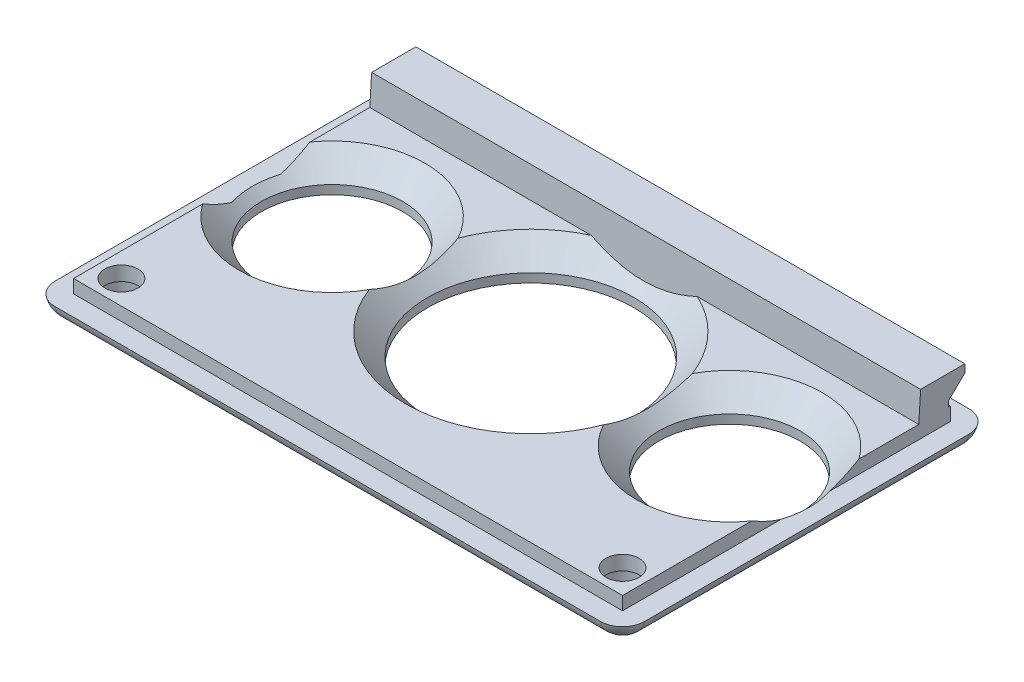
ISO-10303-21;
HEADER;
FILE_DESCRIPTION(('STEP AP214'),'2;1');
FILE_NAME('part.step','',(''),(''),'','','');
FILE_SCHEMA(('AUTOMOTIVE_DESIGN { 1 0 10303 214 1 1 1 1 }'));
ENDSEC;
DATA;
#1=APPLICATION_CONTEXT('core data for automotive mechanical design processes');
#2=APPLICATION_PROTOCOL_DEFINITION('international standard','automotive_design',2000,#1);
#3=PRODUCT_CONTEXT('',#1,'mechanical');
#4=PRODUCT('Part','Part','',(#3));
#5=PRODUCT_RELATED_PRODUCT_CATEGORY('part','',(#4));
#6=PRODUCT_DEFINITION_FORMATION('','',#4);
#7=PRODUCT_DEFINITION_CONTEXT('part definition',#1,'design');
#8=PRODUCT_DEFINITION('design','',#6,#7);
#9=PRODUCT_DEFINITION_SHAPE('','',#8);
#10=(LENGTH_UNIT() NAMED_UNIT(*) SI_UNIT(.MILLI.,.METRE.));
#11=(NAMED_UNIT(*) PLANE_ANGLE_UNIT() SI_UNIT($,.RADIAN.));
#12=(NAMED_UNIT(*) SI_UNIT($,.STERADIAN.) SOLID_ANGLE_UNIT());
#13=UNCERTAINTY_MEASURE_WITH_UNIT(LENGTH_MEASURE(1.E-05),#10,'distance_accuracy_value','');
#14=(GEOMETRIC_REPRESENTATION_CONTEXT(3) GLOBAL_UNCERTAINTY_ASSIGNED_CONTEXT((#13)) GLOBAL_UNIT_ASSIGNED_CONTEXT((#10,
#11,#12)) REPRESENTATION_CONTEXT('',''));
#15=CARTESIAN_POINT('',(0.,0.,0.));
#16=DIRECTION('',(0.,0.,1.));
#17=DIRECTION('',(1.,0.,0.));
#18=AXIS2_PLACEMENT_3D('',#15,#16,#17);
#19=CARTESIAN_POINT('',(1.50366568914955,4.2,-48.4230205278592));
#20=DIRECTION('',(1.,0.,0.));
#21=DIRECTION('',(0.,0.,-1.));
#22=AXIS2_PLACEMENT_3D('',#19,#20,#21);
#23=PLANE('',#22);
#24=DIRECTION('',(0.,0.,1.));
#25=VECTOR('',#24,1.);
#26=CARTESIAN_POINT('',(1.50366568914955,4.2,-48.4230205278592));
#27=LINE('',#26,#25);
#28=CARTESIAN_POINT('',(1.50366568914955,4.2,-21.4443685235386));
#29=VERTEX_POINT('',#28);
#30=CARTESIAN_POINT('',(1.50366568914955,4.2,-3.92302052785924));
#31=VERTEX_POINT('',#30);
#32=EDGE_CURVE('E321',#29,#31,#27,.T.);
#33=ORIENTED_EDGE('',*,*,#32,.F.);
#34=CARTESIAN_POINT('',(1.50366568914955,4.2,-21.4443685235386));
#35=CARTESIAN_POINT('',(1.50366568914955,4.0910620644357,-21.6329773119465));
#36=CARTESIAN_POINT('',(1.50366568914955,3.98420912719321,-21.8228077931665));
#37=CARTESIAN_POINT('',(1.50366568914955,3.77530995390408,-22.2051455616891));
#38=CARTESIAN_POINT('',(1.50366568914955,3.67326476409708,-22.397653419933));
#39=CARTESIAN_POINT('',(1.50366568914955,3.47519291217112,-22.7844679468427));
#40=CARTESIAN_POINT('',(1.50366568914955,3.37913716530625,-22.9787596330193));
#41=CARTESIAN_POINT('',(1.50366568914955,3.19324885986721,-23.3702760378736));
#42=CARTESIAN_POINT('',(1.50366568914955,3.10341620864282,-23.5675007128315));
#43=CARTESIAN_POINT('',(1.50366568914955,2.8442324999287,-24.1644796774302));
#44=CARTESIAN_POINT('',(1.50366568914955,2.68547636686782,-24.5690008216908));
#45=CARTESIAN_POINT('',(1.50366568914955,2.40382511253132,-25.392615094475));
#46=CARTESIAN_POINT('',(1.50366568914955,2.28112452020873,-25.8117740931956));
#47=CARTESIAN_POINT('',(1.50366568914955,2.18117741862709,-26.2370417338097));
#48=B_SPLINE_CURVE_WITH_KNOTS('',3,(#34,#35,#36,#37,#38,#39,#40,#41,#42,#43,#44,#45,#46,#47),
.UNSPECIFIED.,.F.,.F.,(4,2,2,2,2,2,4),(0.,0.653434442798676,1.30701043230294,1.95711545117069,
2.60721078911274,3.90921891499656,5.21812789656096),.UNSPECIFIED.);
#49=CARTESIAN_POINT('',(1.50366568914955,2.4,-25.4277549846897));
#50=VERTEX_POINT('',#49);
#51=EDGE_CURVE('E71',#29,#50,#48,.T.);
#52=ORIENTED_EDGE('',*,*,#51,.T.);
#53=DIRECTION('',(0.,0.,1.));
#54=VECTOR('',#53,1.);
#55=CARTESIAN_POINT('',(1.50366568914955,2.4,-48.4230205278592));
#56=LINE('',#55,#54);
#57=CARTESIAN_POINT('',(1.50366568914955,2.4,-3.92302052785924));
#58=VERTEX_POINT('',#57);
#59=EDGE_CURVE('E338',#50,#58,#56,.T.);
#60=ORIENTED_EDGE('',*,*,#59,.T.);
#61=DIRECTION('',(0.,-1.,0.));
#62=VECTOR('',#61,1.);
#63=CARTESIAN_POINT('',(1.50366568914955,4.2,-3.92302052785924));
#64=LINE('',#63,#62);
#65=EDGE_CURVE('E349',#31,#58,#64,.T.);
#66=ORIENTED_EDGE('',*,*,#65,.F.);
#67=EDGE_LOOP('',(#33,#52,#60,#66));
#68=FACE_BOUND('',#67,.T.);
#69=ADVANCED_FACE('F47',(#68),#23,.F.);
#70=CARTESIAN_POINT('',(76.0036656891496,4.2,-48.4230205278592));
#71=DIRECTION('',(-1.,0.,0.));
#72=DIRECTION('',(0.,0.,1.));
#73=AXIS2_PLACEMENT_3D('',#70,#71,#72);
#74=PLANE('',#73);
#75=DIRECTION('',(0.,0.,-1.));
#76=VECTOR('',#75,1.);
#77=CARTESIAN_POINT('',(76.0036656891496,4.2,-48.4230205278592));
#78=LINE('',#77,#76);
#79=CARTESIAN_POINT('',(76.0036656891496,4.2,-36.0016725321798));
#80=VERTEX_POINT('',#79);
#81=CARTESIAN_POINT('',(76.0036656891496,4.2,-44.1230205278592));
#82=VERTEX_POINT('',#81);
#83=EDGE_CURVE('E318',#80,#82,#78,.T.);
#84=ORIENTED_EDGE('',*,*,#83,.F.);
#85=CARTESIAN_POINT('',(76.0036656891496,4.2,-36.0016725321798));
#86=CARTESIAN_POINT('',(76.0036656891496,4.0910620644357,-35.8130637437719));
#87=CARTESIAN_POINT('',(76.0036656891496,3.98420912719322,-35.623233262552));
#88=CARTESIAN_POINT('',(76.0036656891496,3.77530995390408,-35.2408954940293));
#89=CARTESIAN_POINT('',(76.0036656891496,3.67326476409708,-35.0483876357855));
#90=CARTESIAN_POINT('',(76.0036656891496,3.47519291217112,-34.6615731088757));
#91=CARTESIAN_POINT('',(76.0036656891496,3.37913716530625,-34.4672814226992));
#92=CARTESIAN_POINT('',(76.0036656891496,3.19324885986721,-34.0757650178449));
#93=CARTESIAN_POINT('',(76.0036656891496,3.10341620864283,-33.878540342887));
#94=CARTESIAN_POINT('',(76.0036656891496,2.84423249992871,-33.2815613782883));
#95=CARTESIAN_POINT('',(76.0036656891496,2.68547636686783,-32.8770402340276));
#96=CARTESIAN_POINT('',(76.0036656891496,2.40382511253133,-32.0534259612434));
#97=CARTESIAN_POINT('',(76.0036656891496,2.28112452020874,-31.6342669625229));
#98=CARTESIAN_POINT('',(76.0036656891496,2.1811774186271,-31.2089993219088));
#99=B_SPLINE_CURVE_WITH_KNOTS('',3,(#85,#86,#87,#88,#89,#90,#91,#92,#93,#94,#95,#96,#97,#98),
.UNSPECIFIED.,.F.,.F.,(4,2,2,2,2,2,4),(0.,0.653434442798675,1.30701043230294,1.95711545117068,
2.60721078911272,3.90921891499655,5.21812789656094),.UNSPECIFIED.);
#100=CARTESIAN_POINT('',(76.0036656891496,2.4,-32.0182860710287));
#101=VERTEX_POINT('',#100);
#102=EDGE_CURVE('E476',#80,#101,#99,.T.);
#103=ORIENTED_EDGE('',*,*,#102,.T.);
#104=DIRECTION('',(0.,0.,-1.));
#105=VECTOR('',#104,1.);
#106=CARTESIAN_POINT('',(76.0036656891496,2.4,-48.4230205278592));
#107=LINE('',#106,#105);
#108=CARTESIAN_POINT('',(76.0036656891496,2.4,-48.4230205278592));
#109=VERTEX_POINT('',#108);
#110=EDGE_CURVE('E312',#101,#109,#107,.T.);
#111=ORIENTED_EDGE('',*,*,#110,.T.);
#112=DIRECTION('',(0.,-1.,0.));
#113=VECTOR('',#112,1.);
#114=CARTESIAN_POINT('',(76.0036656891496,4.2,-48.4230205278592));
#115=LINE('',#114,#113);
#116=CARTESIAN_POINT('',(76.0036656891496,4.2,-48.4230205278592));
#117=VERTEX_POINT('',#116);
#118=EDGE_CURVE('E357',#117,#109,#115,.T.);
#119=ORIENTED_EDGE('',*,*,#118,.F.);
#120=CARTESIAN_POINT('',(76.0036656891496,4.2,-48.1230205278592));
#121=VERTEX_POINT('',#120);
#122=EDGE_CURVE('E252',#121,#117,#78,.T.);
#123=ORIENTED_EDGE('',*,*,#122,.F.);
#124=DIRECTION('',(0.,0.999687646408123,-0.0249921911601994));
#125=VECTOR('',#124,1.);
#126=CARTESIAN_POINT('',(76.0036656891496,4.97826358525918,-48.1424771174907));
#127=LINE('',#126,#125);
#128=CARTESIAN_POINT('',(76.0036656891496,4.97826358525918,-48.1424771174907));
#129=VERTEX_POINT('',#128);
#130=EDGE_CURVE('E229',#121,#129,#127,.T.);
#131=ORIENTED_EDGE('',*,*,#130,.T.);
#132=DIRECTION('',(0.,0.689213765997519,-0.724558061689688));
#133=VECTOR('',#132,1.);
#134=CARTESIAN_POINT('',(76.0036656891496,4.97826358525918,-48.1424771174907));
#135=LINE('',#134,#133);
#136=CARTESIAN_POINT('',(76.0036656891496,7.1,-50.3730205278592));
#137=VERTEX_POINT('',#136);
#138=EDGE_CURVE('E239',#129,#137,#135,.T.);
#139=ORIENTED_EDGE('',*,*,#138,.T.);
#140=DIRECTION('',(0.,1.,0.));
#141=VECTOR('',#140,1.);
#142=CARTESIAN_POINT('',(76.0036656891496,8.2,-50.3730205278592));
#143=LINE('',#142,#141);
#144=CARTESIAN_POINT('',(76.0036656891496,8.2,-50.3730205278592));
#145=VERTEX_POINT('',#144);
#146=EDGE_CURVE('E246',#137,#145,#143,.T.);
#147=ORIENTED_EDGE('',*,*,#146,.T.);
#148=DIRECTION('',(0.,0.,1.));
#149=VECTOR('',#148,1.);
#150=CARTESIAN_POINT('',(76.0036656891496,8.2,-44.3730205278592));
#151=LINE('',#150,#149);
#152=CARTESIAN_POINT('',(76.0036656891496,8.2,-44.3730205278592));
#153=VERTEX_POINT('',#152);
#154=EDGE_CURVE('E265',#145,#153,#151,.T.);
#155=ORIENTED_EDGE('',*,*,#154,.T.);
#156=DIRECTION('',(0.,-0.998052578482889,0.0623782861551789));
#157=VECTOR('',#156,1.);
#158=CARTESIAN_POINT('',(76.0036656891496,4.2,-44.1230205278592));
#159=LINE('',#158,#157);
#160=EDGE_CURVE('E236',#153,#82,#159,.T.);
#161=ORIENTED_EDGE('',*,*,#160,.T.);
#162=EDGE_LOOP('',(#84,#103,#111,#119,#123,#131,#139,#147,#155,#161));
#163=FACE_BOUND('',#162,.T.);
#164=ADVANCED_FACE('F250',(#163),#74,.F.);
#165=CARTESIAN_POINT('',(0.,4.2,0.));
#166=DIRECTION('',(0.,1.,0.));
#167=DIRECTION('',(0.,0.,1.));
#168=AXIS2_PLACEMENT_3D('',#165,#166,#167);
#169=PLANE('',#168);
#170=CARTESIAN_POINT('',(38.7536656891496,4.2,-28.7230205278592));
#171=DIRECTION('',(0.,1.,0.));
#172=DIRECTION('',(0.,0.,1.));
#173=AXIS2_PLACEMENT_3D('',#170,#171,#172);
#174=CIRCLE('',#173,17.);
#175=CARTESIAN_POINT('',(45.9536656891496,4.2,-44.1230205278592));
#176=VERTEX_POINT('',#175);
#177=CARTESIAN_POINT('',(54.6511480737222,4.2,-34.7454829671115));
#178=VERTEX_POINT('',#177);
#179=EDGE_CURVE('E460',#176,#178,#174,.F.);
#180=ORIENTED_EDGE('',*,*,#179,.T.);
#181=CARTESIAN_POINT('',(65.7186656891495,4.2,-28.7230205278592));
#182=DIRECTION('',(0.,1.,0.));
#183=DIRECTION('',(0.,0.,1.));
#184=AXIS2_PLACEMENT_3D('',#181,#182,#183);
#185=CIRCLE('',#184,12.6);
#186=EDGE_CURVE('E463',#178,#80,#185,.F.);
#187=ORIENTED_EDGE('',*,*,#186,.T.);
#188=ORIENTED_EDGE('',*,*,#83,.T.);
#189=DIRECTION('',(1.,0.,0.));
#190=VECTOR('',#189,1.);
#191=CARTESIAN_POINT('',(-5.91674535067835,4.2,-44.1230205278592));
#192=LINE('',#191,#190);
#193=EDGE_CURVE('E280',#176,#82,#192,.T.);
#194=ORIENTED_EDGE('',*,*,#193,.F.);
#195=EDGE_LOOP('',(#180,#187,#188,#194));
#196=FACE_BOUND('',#195,.T.);
#197=ADVANCED_FACE('F604',(#196),#169,.T.);
#198=CARTESIAN_POINT('',(72.7536656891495,4.2,-7.17302052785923));
#199=DIRECTION('',(0.,-1.,0.));
#200=DIRECTION('',(0.,0.,-1.));
#201=AXIS2_PLACEMENT_3D('',#198,#199,#200);
#202=CIRCLE('',#201,2.25);
#203=CARTESIAN_POINT('',(72.7536656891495,4.2,-9.42302052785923));
#204=VERTEX_POINT('',#203);
#205=EDGE_CURVE('E302',#204,#204,#202,.T.);
#206=ORIENTED_EDGE('',*,*,#205,.T.);
#207=EDGE_LOOP('',(#206));
#208=FACE_BOUND('',#207,.T.);
#209=CARTESIAN_POINT('',(4.75366568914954,4.2,-7.17302052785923));
#210=DIRECTION('',(0.,-1.,0.));
#211=DIRECTION('',(0.,0.,-1.));
#212=AXIS2_PLACEMENT_3D('',#209,#210,#211);
#213=CIRCLE('',#212,2.25);
#214=CARTESIAN_POINT('',(4.75366568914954,4.2,-9.42302052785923));
#215=VERTEX_POINT('',#214);
#216=EDGE_CURVE('E292',#215,#215,#213,.T.);
#217=ORIENTED_EDGE('',*,*,#216,.T.);
#218=EDGE_LOOP('',(#217));
#219=FACE_BOUND('',#218,.T.);
#220=CARTESIAN_POINT('',(76.0036656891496,4.2,-3.92302052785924));
#221=VERTEX_POINT('',#220);
#222=CARTESIAN_POINT('',(76.0036656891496,4.2,-21.4443685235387));
#223=VERTEX_POINT('',#222);
#224=EDGE_CURVE('E313',#221,#223,#78,.T.);
#225=ORIENTED_EDGE('',*,*,#224,.T.);
#226=CARTESIAN_POINT('',(65.7186656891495,4.2,-28.7230205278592));
#227=DIRECTION('',(0.,1.,0.));
#228=DIRECTION('',(0.,0.,1.));
#229=AXIS2_PLACEMENT_3D('',#226,#227,#228);
#230=CIRCLE('',#229,12.6);
#231=CARTESIAN_POINT('',(54.6511480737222,4.2,-22.700558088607));
#232=VERTEX_POINT('',#231);
#233=EDGE_CURVE('E457',#223,#232,#230,.F.);
#234=ORIENTED_EDGE('',*,*,#233,.T.);
#235=CARTESIAN_POINT('',(38.7536656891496,4.2,-28.7230205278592));
#236=DIRECTION('',(0.,1.,0.));
#237=DIRECTION('',(0.,0.,1.));
#238=AXIS2_PLACEMENT_3D('',#235,#236,#237);
#239=CIRCLE('',#238,17.);
#240=CARTESIAN_POINT('',(22.856183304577,4.2,-22.700558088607));
#241=VERTEX_POINT('',#240);
#242=EDGE_CURVE('E454',#232,#241,#239,.F.);
#243=ORIENTED_EDGE('',*,*,#242,.T.);
#244=CARTESIAN_POINT('',(11.7886656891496,4.2,-28.7230205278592));
#245=DIRECTION('',(0.,1.,0.));
#246=DIRECTION('',(0.,0.,1.));
#247=AXIS2_PLACEMENT_3D('',#244,#245,#246);
#248=CIRCLE('',#247,12.6);
#249=EDGE_CURVE('E451',#241,#29,#248,.F.);
#250=ORIENTED_EDGE('',*,*,#249,.T.);
#251=ORIENTED_EDGE('',*,*,#32,.T.);
#252=DIRECTION('',(1.,0.,0.));
#253=VECTOR('',#252,1.);
#254=CARTESIAN_POINT('',(1.50366568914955,4.2,-3.92302052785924));
#255=LINE('',#254,#253);
#256=EDGE_CURVE('E325',#31,#221,#255,.T.);
#257=ORIENTED_EDGE('',*,*,#256,.T.);
#258=EDGE_LOOP('',(#225,#234,#243,#250,#251,#257));
#259=FACE_BOUND('',#258,.T.);
#260=ADVANCED_FACE('F591',(#208,#219,#259),#169,.T.);
#261=CARTESIAN_POINT('',(72.7536656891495,4.2,-7.17302052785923));
#262=DIRECTION('',(0.,-1.,0.));
#263=DIRECTION('',(0.,0.,-1.));
#264=AXIS2_PLACEMENT_3D('',#261,#262,#263);
#265=CYLINDRICAL_SURFACE('',#264,2.25);
#266=ORIENTED_EDGE('',*,*,#205,.F.);
#267=EDGE_LOOP('',(#266));
#268=FACE_BOUND('',#267,.T.);
#269=CARTESIAN_POINT('',(72.7536656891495,2.25,-7.17302052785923));
#270=DIRECTION('',(0.,-1.,0.));
#271=DIRECTION('',(0.,0.,-1.));
#272=AXIS2_PLACEMENT_3D('',#269,#270,#271);
#273=CIRCLE('',#272,2.25);
#274=CARTESIAN_POINT('',(72.7536656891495,2.25,-9.42302052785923));
#275=VERTEX_POINT('',#274);
#276=EDGE_CURVE('E416',#275,#275,#273,.F.);
#277=ORIENTED_EDGE('',*,*,#276,.F.);
#278=EDGE_LOOP('',(#277));
#279=FACE_BOUND('',#278,.T.);
#280=ADVANCED_FACE('F587',(#268,#279),#265,.F.);
#281=CARTESIAN_POINT('',(4.75366568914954,4.2,-7.17302052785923));
#282=DIRECTION('',(0.,-1.,0.));
#283=DIRECTION('',(0.,0.,-1.));
#284=AXIS2_PLACEMENT_3D('',#281,#282,#283);
#285=CYLINDRICAL_SURFACE('',#284,2.25);
#286=ORIENTED_EDGE('',*,*,#216,.F.);
#287=EDGE_LOOP('',(#286));
#288=FACE_BOUND('',#287,.T.);
#289=CARTESIAN_POINT('',(4.75366568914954,2.25,-7.17302052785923));
#290=DIRECTION('',(0.,-1.,0.));
#291=DIRECTION('',(0.,0.,-1.));
#292=AXIS2_PLACEMENT_3D('',#289,#290,#291);
#293=CIRCLE('',#292,2.25);
#294=CARTESIAN_POINT('',(4.75366568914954,2.25,-9.42302052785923));
#295=VERTEX_POINT('',#294);
#296=EDGE_CURVE('E438',#295,#295,#293,.F.);
#297=ORIENTED_EDGE('',*,*,#296,.F.);
#298=EDGE_LOOP('',(#297));
#299=FACE_BOUND('',#298,.T.);
#300=ADVANCED_FACE('F590',(#288,#299),#285,.F.);
#301=CARTESIAN_POINT('',(1.50366568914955,4.2,-48.4230205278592));
#302=VERTEX_POINT('',#301);
#303=CARTESIAN_POINT('',(1.50366568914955,4.2,-48.1230205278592));
#304=VERTEX_POINT('',#303);
#305=EDGE_CURVE('E322',#302,#304,#27,.T.);
#306=ORIENTED_EDGE('',*,*,#305,.T.);
#307=DIRECTION('',(1.,0.,0.));
#308=VECTOR('',#307,1.);
#309=CARTESIAN_POINT('',(-5.91674535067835,4.2,-48.1230205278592));
#310=LINE('',#309,#308);
#311=EDGE_CURVE('E272',#304,#121,#310,.T.);
#312=ORIENTED_EDGE('',*,*,#311,.T.);
#313=ORIENTED_EDGE('',*,*,#122,.T.);
#314=DIRECTION('',(-1.,0.,0.));
#315=VECTOR('',#314,1.);
#316=CARTESIAN_POINT('',(1.50366568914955,4.2,-48.4230205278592));
#317=LINE('',#316,#315);
#318=EDGE_CURVE('E317',#117,#302,#317,.T.);
#319=ORIENTED_EDGE('',*,*,#318,.T.);
#320=EDGE_LOOP('',(#306,#312,#313,#319));
#321=FACE_BOUND('',#320,.T.);
#322=ADVANCED_FACE('F499',(#321),#169,.T.);
#323=CARTESIAN_POINT('',(0.,2.4,0.));
#324=DIRECTION('',(0.,-1.,0.));
#325=DIRECTION('',(0.,0.,-1.));
#326=AXIS2_PLACEMENT_3D('',#323,#324,#325);
#327=PLANE('',#326);
#328=DIRECTION('',(-1.,0.,0.));
#329=VECTOR('',#328,1.);
#330=CARTESIAN_POINT('',(-1.24633431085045,2.4,-51.1730205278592));
#331=LINE('',#330,#329);
#332=CARTESIAN_POINT('',(75.7536656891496,2.4,-51.1730205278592));
#333=VERTEX_POINT('',#332);
#334=CARTESIAN_POINT('',(1.75366568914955,2.4,-51.1730205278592));
#335=VERTEX_POINT('',#334);
#336=EDGE_CURVE('E370',#333,#335,#331,.T.);
#337=ORIENTED_EDGE('',*,*,#336,.T.);
#338=CARTESIAN_POINT('',(1.75366568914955,2.4,-48.1730205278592));
#339=DIRECTION('',(0.,-1.,0.));
#340=DIRECTION('',(0.,0.,-1.));
#341=AXIS2_PLACEMENT_3D('',#338,#339,#340);
#342=CIRCLE('',#341,3.);
#343=CARTESIAN_POINT('',(-1.24633431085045,2.4,-48.1730205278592));
#344=VERTEX_POINT('',#343);
#345=EDGE_CURVE('E382',#335,#344,#342,.F.);
#346=ORIENTED_EDGE('',*,*,#345,.T.);
#347=DIRECTION('',(0.,0.,1.));
#348=VECTOR('',#347,1.);
#349=CARTESIAN_POINT('',(-1.24633431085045,2.4,-1.17302052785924));
#350=LINE('',#349,#348);
#351=CARTESIAN_POINT('',(-1.24633431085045,2.4,-4.17302052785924));
#352=VERTEX_POINT('',#351);
#353=EDGE_CURVE('E361',#344,#352,#350,.T.);
#354=ORIENTED_EDGE('',*,*,#353,.T.);
#355=CARTESIAN_POINT('',(1.75366568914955,2.4,-4.17302052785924));
#356=DIRECTION('',(0.,-1.,0.));
#357=DIRECTION('',(0.,0.,-1.));
#358=AXIS2_PLACEMENT_3D('',#355,#356,#357);
#359=CIRCLE('',#358,3.);
#360=CARTESIAN_POINT('',(1.75366568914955,2.4,-1.17302052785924));
#361=VERTEX_POINT('',#360);
#362=EDGE_CURVE('E379',#352,#361,#359,.F.);
#363=ORIENTED_EDGE('',*,*,#362,.T.);
#364=DIRECTION('',(1.,0.,0.));
#365=VECTOR('',#364,1.);
#366=CARTESIAN_POINT('',(-1.24633431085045,2.4,-1.17302052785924));
#367=LINE('',#366,#365);
#368=CARTESIAN_POINT('',(75.7536656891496,2.4,-1.17302052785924));
#369=VERTEX_POINT('',#368);
#370=EDGE_CURVE('E364',#361,#369,#367,.T.);
#371=ORIENTED_EDGE('',*,*,#370,.T.);
#372=CARTESIAN_POINT('',(75.7536656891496,2.4,-4.17302052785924));
#373=DIRECTION('',(0.,-1.,0.));
#374=DIRECTION('',(0.,0.,-1.));
#375=AXIS2_PLACEMENT_3D('',#372,#373,#374);
#376=CIRCLE('',#375,3.);
#377=CARTESIAN_POINT('',(78.7536656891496,2.4,-4.17302052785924));
#378=VERTEX_POINT('',#377);
#379=EDGE_CURVE('E376',#369,#378,#376,.F.);
#380=ORIENTED_EDGE('',*,*,#379,.T.);
#381=DIRECTION('',(0.,0.,-1.));
#382=VECTOR('',#381,1.);
#383=CARTESIAN_POINT('',(78.7536656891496,2.4,-1.17302052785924));
#384=LINE('',#383,#382);
#385=CARTESIAN_POINT('',(78.7536656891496,2.4,-48.1730205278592));
#386=VERTEX_POINT('',#385);
#387=EDGE_CURVE('E367',#378,#386,#384,.T.);
#388=ORIENTED_EDGE('',*,*,#387,.T.);
#389=CARTESIAN_POINT('',(75.7536656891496,2.4,-48.1730205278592));
#390=DIRECTION('',(0.,-1.,0.));
#391=DIRECTION('',(0.,0.,-1.));
#392=AXIS2_PLACEMENT_3D('',#389,#390,#391);
#393=CIRCLE('',#392,3.);
#394=EDGE_CURVE('E373',#386,#333,#393,.F.);
#395=ORIENTED_EDGE('',*,*,#394,.T.);
#396=EDGE_LOOP('',(#337,#346,#354,#363,#371,#380,#388,#395));
#397=FACE_BOUND('',#396,.T.);
#398=ORIENTED_EDGE('',*,*,#110,.F.);
#399=CARTESIAN_POINT('',(65.7186656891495,2.4,-28.7230205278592));
#400=DIRECTION('',(0.,-1.,0.));
#401=DIRECTION('',(0.,0.,-1.));
#402=AXIS2_PLACEMENT_3D('',#399,#400,#401);
#403=CIRCLE('',#402,10.8);
#404=CARTESIAN_POINT('',(76.0036656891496,2.4,-25.4277549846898));
#405=VERTEX_POINT('',#404);
#406=EDGE_CURVE('E637',#101,#405,#403,.T.);
#407=ORIENTED_EDGE('',*,*,#406,.T.);
#408=CARTESIAN_POINT('',(76.0036656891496,2.4,-3.92302052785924));
#409=VERTEX_POINT('',#408);
#410=EDGE_CURVE('E330',#409,#405,#107,.T.);
#411=ORIENTED_EDGE('',*,*,#410,.F.);
#412=DIRECTION('',(1.,0.,0.));
#413=VECTOR('',#412,1.);
#414=CARTESIAN_POINT('',(1.50366568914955,2.4,-3.92302052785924));
#415=LINE('',#414,#413);
#416=EDGE_CURVE('E342',#58,#409,#415,.T.);
#417=ORIENTED_EDGE('',*,*,#416,.F.);
#418=ORIENTED_EDGE('',*,*,#59,.F.);
#419=CARTESIAN_POINT('',(11.7886656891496,2.4,-28.7230205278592));
#420=DIRECTION('',(0.,-1.,0.));
#421=DIRECTION('',(0.,0.,-1.));
#422=AXIS2_PLACEMENT_3D('',#419,#420,#421);
#423=CIRCLE('',#422,10.8);
#424=CARTESIAN_POINT('',(1.50366568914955,2.4,-32.0182860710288));
#425=VERTEX_POINT('',#424);
#426=EDGE_CURVE('E78',#50,#425,#423,.T.);
#427=ORIENTED_EDGE('',*,*,#426,.T.);
#428=CARTESIAN_POINT('',(1.50366568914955,2.4,-48.4230205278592));
#429=VERTEX_POINT('',#428);
#430=EDGE_CURVE('E339',#429,#425,#56,.T.);
#431=ORIENTED_EDGE('',*,*,#430,.F.);
#432=DIRECTION('',(-1.,0.,0.));
#433=VECTOR('',#432,1.);
#434=CARTESIAN_POINT('',(1.50366568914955,2.4,-48.4230205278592));
#435=LINE('',#434,#433);
#436=EDGE_CURVE('E334',#109,#429,#435,.T.);
#437=ORIENTED_EDGE('',*,*,#436,.F.);
#438=EDGE_LOOP('',(#398,#407,#411,#417,#418,#427,#431,#437));
#439=FACE_BOUND('',#438,.T.);
#440=ADVANCED_FACE('F495',(#397,#439),#327,.F.);
#441=CARTESIAN_POINT('',(0.,0.,0.));
#442=DIRECTION('',(0.,-1.,0.));
#443=DIRECTION('',(0.,0.,-1.));
#444=AXIS2_PLACEMENT_3D('',#441,#442,#443);
#445=PLANE('',#444);
#446=CARTESIAN_POINT('',(4.75366568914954,0.,-7.17302052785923));
#447=DIRECTION('',(0.,-1.,0.));
#448=DIRECTION('',(0.,0.,-1.));
#449=AXIS2_PLACEMENT_3D('',#446,#447,#448);
#450=CIRCLE('',#449,3.);
#451=CARTESIAN_POINT('',(4.75366568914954,0.,-10.1730205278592));
#452=VERTEX_POINT('',#451);
#453=EDGE_CURVE('E721',#452,#452,#450,.T.);
#454=ORIENTED_EDGE('',*,*,#453,.F.);
#455=EDGE_LOOP('',(#454));
#456=FACE_BOUND('',#455,.T.);
#457=CARTESIAN_POINT('',(72.7536656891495,0.,-7.17302052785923));
#458=DIRECTION('',(0.,-1.,0.));
#459=DIRECTION('',(0.,0.,-1.));
#460=AXIS2_PLACEMENT_3D('',#457,#458,#459);
#461=CIRCLE('',#460,3.00000000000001);
#462=CARTESIAN_POINT('',(72.7536656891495,0.,-10.1730205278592));
#463=VERTEX_POINT('',#462);
#464=EDGE_CURVE('E715',#463,#463,#461,.T.);
#465=ORIENTED_EDGE('',*,*,#464,.F.);
#466=EDGE_LOOP('',(#465));
#467=FACE_BOUND('',#466,.T.);
#468=DIRECTION('',(0.,0.,1.));
#469=VECTOR('',#468,1.);
#470=CARTESIAN_POINT('',(1.69305338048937,0.,-48.1730205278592));
#471=LINE('',#470,#469);
#472=CARTESIAN_POINT('',(1.69305338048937,0.,-4.17302052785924));
#473=VERTEX_POINT('',#472);
#474=CARTESIAN_POINT('',(1.69305338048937,0.,-48.1730205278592));
#475=VERTEX_POINT('',#474);
#476=EDGE_CURVE('E386',#473,#475,#471,.F.);
#477=ORIENTED_EDGE('',*,*,#476,.T.);
#478=CARTESIAN_POINT('',(1.75366568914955,0.,-48.1730205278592));
#479=DIRECTION('',(0.,-1.,0.));
#480=DIRECTION('',(0.,0.,-1.));
#481=AXIS2_PLACEMENT_3D('',#478,#479,#480);
#482=CIRCLE('',#481,0.0606123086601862);
#483=CARTESIAN_POINT('',(1.75366568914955,0.,-48.2336328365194));
#484=VERTEX_POINT('',#483);
#485=EDGE_CURVE('E407',#475,#484,#482,.T.);
#486=ORIENTED_EDGE('',*,*,#485,.T.);
#487=DIRECTION('',(-1.,0.,0.));
#488=VECTOR('',#487,1.);
#489=CARTESIAN_POINT('',(75.7536656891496,0.,-48.2336328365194));
#490=LINE('',#489,#488);
#491=CARTESIAN_POINT('',(75.7536656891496,0.,-48.2336328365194));
#492=VERTEX_POINT('',#491);
#493=EDGE_CURVE('E404',#484,#492,#490,.F.);
#494=ORIENTED_EDGE('',*,*,#493,.T.);
#495=CARTESIAN_POINT('',(75.7536656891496,0.,-48.1730205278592));
#496=DIRECTION('',(0.,-1.,0.));
#497=DIRECTION('',(0.,0.,-1.));
#498=AXIS2_PLACEMENT_3D('',#495,#496,#497);
#499=CIRCLE('',#498,0.0606123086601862);
#500=CARTESIAN_POINT('',(75.8142779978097,0.,-48.1730205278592));
#501=VERTEX_POINT('',#500);
#502=EDGE_CURVE('E401',#492,#501,#499,.T.);
#503=ORIENTED_EDGE('',*,*,#502,.T.);
#504=DIRECTION('',(0.,0.,-1.));
#505=VECTOR('',#504,1.);
#506=CARTESIAN_POINT('',(75.8142779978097,0.,-4.17302052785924));
#507=LINE('',#506,#505);
#508=CARTESIAN_POINT('',(75.8142779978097,0.,-4.17302052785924));
#509=VERTEX_POINT('',#508);
#510=EDGE_CURVE('E398',#501,#509,#507,.F.);
#511=ORIENTED_EDGE('',*,*,#510,.T.);
#512=CARTESIAN_POINT('',(75.7536656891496,0.,-4.17302052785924));
#513=DIRECTION('',(0.,-1.,0.));
#514=DIRECTION('',(0.,0.,-1.));
#515=AXIS2_PLACEMENT_3D('',#512,#513,#514);
#516=CIRCLE('',#515,0.0606123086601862);
#517=CARTESIAN_POINT('',(75.7536656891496,0.,-4.11240821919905));
#518=VERTEX_POINT('',#517);
#519=EDGE_CURVE('E395',#509,#518,#516,.T.);
#520=ORIENTED_EDGE('',*,*,#519,.T.);
#521=DIRECTION('',(1.,0.,0.));
#522=VECTOR('',#521,1.);
#523=CARTESIAN_POINT('',(1.75366568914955,0.,-4.11240821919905));
#524=LINE('',#523,#522);
#525=CARTESIAN_POINT('',(1.75366568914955,0.,-4.11240821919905));
#526=VERTEX_POINT('',#525);
#527=EDGE_CURVE('E392',#518,#526,#524,.F.);
#528=ORIENTED_EDGE('',*,*,#527,.T.);
#529=CARTESIAN_POINT('',(1.75366568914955,0.,-4.17302052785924));
#530=DIRECTION('',(0.,-1.,0.));
#531=DIRECTION('',(0.,0.,-1.));
#532=AXIS2_PLACEMENT_3D('',#529,#530,#531);
#533=CIRCLE('',#532,0.0606123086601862);
#534=EDGE_CURVE('E389',#526,#473,#533,.T.);
#535=ORIENTED_EDGE('',*,*,#534,.T.);
#536=EDGE_LOOP('',(#477,#486,#494,#503,#511,#520,#528,#535));
#537=FACE_BOUND('',#536,.T.);
#538=CARTESIAN_POINT('',(11.7886656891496,0.,-28.7230205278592));
#539=DIRECTION('',(0.,-1.,0.));
#540=DIRECTION('',(0.,0.,-1.));
#541=AXIS2_PLACEMENT_3D('',#538,#539,#540);
#542=CIRCLE('',#541,9.6);
#543=CARTESIAN_POINT('',(11.7886656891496,0.,-38.3230205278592));
#544=VERTEX_POINT('',#543);
#545=EDGE_CURVE('E298',#544,#544,#542,.T.);
#546=ORIENTED_EDGE('',*,*,#545,.F.);
#547=EDGE_LOOP('',(#546));
#548=FACE_BOUND('',#547,.T.);
#549=CARTESIAN_POINT('',(38.7536656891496,0.,-28.7230205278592));
#550=DIRECTION('',(0.,-1.,0.));
#551=DIRECTION('',(0.,0.,-1.));
#552=AXIS2_PLACEMENT_3D('',#549,#550,#551);
#553=CIRCLE('',#552,14.);
#554=CARTESIAN_POINT('',(38.7536656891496,0.,-42.7230205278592));
#555=VERTEX_POINT('',#554);
#556=EDGE_CURVE('E293',#555,#555,#553,.T.);
#557=ORIENTED_EDGE('',*,*,#556,.F.);
#558=EDGE_LOOP('',(#557));
#559=FACE_BOUND('',#558,.T.);
#560=CARTESIAN_POINT('',(65.7186656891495,0.,-28.7230205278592));
#561=DIRECTION('',(0.,-1.,0.));
#562=DIRECTION('',(0.,0.,-1.));
#563=AXIS2_PLACEMENT_3D('',#560,#561,#562);
#564=CIRCLE('',#563,9.6);
#565=CARTESIAN_POINT('',(65.7186656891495,0.,-38.3230205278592));
#566=VERTEX_POINT('',#565);
#567=EDGE_CURVE('E297',#566,#566,#564,.T.);
#568=ORIENTED_EDGE('',*,*,#567,.F.);
#569=EDGE_LOOP('',(#568));
#570=FACE_BOUND('',#569,.T.);
#571=ADVANCED_FACE('F492',(#456,#467,#537,#548,#559,#570),#445,.T.);
#572=ORIENTED_EDGE('',*,*,#410,.T.);
#573=CARTESIAN_POINT('',(76.0036656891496,2.4,-25.4277549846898));
#574=CARTESIAN_POINT('',(76.0036656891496,2.48873889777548,-25.1370082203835));
#575=CARTESIAN_POINT('',(76.0036656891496,2.58712247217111,-24.8493850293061));
#576=CARTESIAN_POINT('',(76.0036656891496,2.80030190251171,-24.2805932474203));
#577=CARTESIAN_POINT('',(76.0036656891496,2.91508094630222,-23.9994183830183));
#578=CARTESIAN_POINT('',(76.0036656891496,3.15771200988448,-23.4446348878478));
#579=CARTESIAN_POINT('',(76.0036656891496,3.28549040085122,-23.1709936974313));
#580=CARTESIAN_POINT('',(76.0036656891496,3.55239852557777,-22.6292372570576));
#581=CARTESIAN_POINT('',(76.0036656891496,3.69153135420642,-22.3611235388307));
#582=CARTESIAN_POINT('',(76.0036656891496,3.97883850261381,-21.8307068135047));
#583=CARTESIAN_POINT('',(76.0036656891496,4.12698852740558,-21.5683905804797));
#584=CARTESIAN_POINT('',(76.0036656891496,4.43110355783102,-21.048357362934));
#585=CARTESIAN_POINT('',(76.0036656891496,4.58706826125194,-20.7906402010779));
#586=CARTESIAN_POINT('',(76.0036656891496,4.90643466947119,-20.2778736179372));
#587=CARTESIAN_POINT('',(76.0036656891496,5.06987301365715,-20.0228471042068));
#588=CARTESIAN_POINT('',(76.0036656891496,5.40233875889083,-19.5165294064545));
#589=CARTESIAN_POINT('',(76.0036656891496,5.57136507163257,-19.2652375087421));
#590=CARTESIAN_POINT('',(76.0036656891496,5.74270092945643,-19.0155613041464));
#591=B_SPLINE_CURVE_WITH_KNOTS('',3,(#573,#574,#575,#576,#577,#578,#579,#580,#581,#582,#583,
#584,#585,#586,#587,#588,#589,#590),.UNSPECIFIED.,.F.,.F.,(4,2,2,2,2,2,2,2,4),(0.,
0.911544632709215,1.82216117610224,2.72788025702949,3.6338470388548,4.53747254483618,
5.44106313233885,6.34969529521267,7.25815152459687),.UNSPECIFIED.);
#592=EDGE_CURVE('E467',#405,#223,#591,.T.);
#593=ORIENTED_EDGE('',*,*,#592,.T.);
#594=ORIENTED_EDGE('',*,*,#224,.F.);
#595=DIRECTION('',(0.,-1.,0.));
#596=VECTOR('',#595,1.);
#597=CARTESIAN_POINT('',(76.0036656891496,4.2,-3.92302052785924));
#598=LINE('',#597,#596);
#599=EDGE_CURVE('E329',#221,#409,#598,.T.);
#600=ORIENTED_EDGE('',*,*,#599,.T.);
#601=EDGE_LOOP('',(#572,#593,#594,#600));
#602=FACE_BOUND('',#601,.T.);
#603=ADVANCED_FACE('F486',(#602),#74,.F.);
#604=CARTESIAN_POINT('',(1.50366568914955,4.2,-48.4230205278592));
#605=DIRECTION('',(0.,0.,1.));
#606=DIRECTION('',(1.,0.,0.));
#607=AXIS2_PLACEMENT_3D('',#604,#605,#606);
#608=PLANE('',#607);
#609=ORIENTED_EDGE('',*,*,#436,.T.);
#610=DIRECTION('',(0.,-1.,0.));
#611=VECTOR('',#610,1.);
#612=CARTESIAN_POINT('',(1.50366568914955,4.2,-48.4230205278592));
#613=LINE('',#612,#611);
#614=EDGE_CURVE('E353',#302,#429,#613,.T.);
#615=ORIENTED_EDGE('',*,*,#614,.F.);
#616=ORIENTED_EDGE('',*,*,#318,.F.);
#617=ORIENTED_EDGE('',*,*,#118,.T.);
#618=EDGE_LOOP('',(#609,#615,#616,#617));
#619=FACE_BOUND('',#618,.T.);
#620=ADVANCED_FACE('F491',(#619),#608,.F.);
#621=ORIENTED_EDGE('',*,*,#430,.T.);
#622=CARTESIAN_POINT('',(1.50366568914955,2.39999999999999,-32.0182860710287));
#623=CARTESIAN_POINT('',(1.50366568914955,2.48873889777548,-32.309032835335));
#624=CARTESIAN_POINT('',(1.50366568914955,2.58712247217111,-32.5966560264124));
#625=CARTESIAN_POINT('',(1.50366568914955,2.80030190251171,-33.1654478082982));
#626=CARTESIAN_POINT('',(1.50366568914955,2.91508094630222,-33.4466226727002));
#627=CARTESIAN_POINT('',(1.50366568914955,3.15771200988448,-34.0014061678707));
#628=CARTESIAN_POINT('',(1.50366568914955,3.28549040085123,-34.2750473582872));
#629=CARTESIAN_POINT('',(1.50366568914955,3.55239852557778,-34.816803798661));
#630=CARTESIAN_POINT('',(1.50366568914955,3.69153135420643,-35.0849175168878));
#631=CARTESIAN_POINT('',(1.50366568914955,3.97883850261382,-35.6153342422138));
#632=CARTESIAN_POINT('',(1.50366568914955,4.1269885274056,-35.8776504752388));
#633=CARTESIAN_POINT('',(1.50366568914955,4.43110355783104,-36.3976836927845));
#634=CARTESIAN_POINT('',(1.50366568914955,4.58706826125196,-36.6554008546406));
#635=CARTESIAN_POINT('',(1.50366568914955,4.90643466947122,-37.1681674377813));
#636=CARTESIAN_POINT('',(1.50366568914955,5.06987301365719,-37.4231939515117));
#637=CARTESIAN_POINT('',(1.50366568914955,5.40233875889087,-37.9295116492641));
#638=CARTESIAN_POINT('',(1.50366568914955,5.57136507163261,-38.1808035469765));
#639=CARTESIAN_POINT('',(1.50366568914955,5.74270092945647,-38.4304797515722));
#640=B_SPLINE_CURVE_WITH_KNOTS('',3,(#622,#623,#624,#625,#626,#627,#628,#629,#630,#631,#632,
#633,#634,#635,#636,#637,#638,#639),.UNSPECIFIED.,.F.,.F.,(4,2,2,2,2,2,2,2,4),(0.,
0.911544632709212,1.82216117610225,2.7278802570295,3.63384703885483,4.53747254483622,
5.44106313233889,6.34969529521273,7.25815152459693),.UNSPECIFIED.);
#641=CARTESIAN_POINT('',(1.50366568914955,4.2,-36.0016725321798));
#642=VERTEX_POINT('',#641);
#643=EDGE_CURVE('E613',#425,#642,#640,.T.);
#644=ORIENTED_EDGE('',*,*,#643,.T.);
#645=CARTESIAN_POINT('',(1.50366568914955,4.2,-44.1230205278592));
#646=VERTEX_POINT('',#645);
#647=EDGE_CURVE('E326',#646,#642,#27,.T.);
#648=ORIENTED_EDGE('',*,*,#647,.F.);
#649=DIRECTION('',(0.,0.998052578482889,-0.0623782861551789));
#650=VECTOR('',#649,1.);
#651=CARTESIAN_POINT('',(1.50366568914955,4.2,-44.1230205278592));
#652=LINE('',#651,#650);
#653=CARTESIAN_POINT('',(1.50366568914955,8.2,-44.3730205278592));
#654=VERTEX_POINT('',#653);
#655=EDGE_CURVE('E672',#646,#654,#652,.T.);
#656=ORIENTED_EDGE('',*,*,#655,.T.);
#657=DIRECTION('',(0.,0.,-1.));
#658=VECTOR('',#657,1.);
#659=CARTESIAN_POINT('',(1.50366568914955,8.2,-44.3730205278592));
#660=LINE('',#659,#658);
#661=CARTESIAN_POINT('',(1.50366568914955,8.2,-50.3730205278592));
#662=VERTEX_POINT('',#661);
#663=EDGE_CURVE('E674',#654,#662,#660,.T.);
#664=ORIENTED_EDGE('',*,*,#663,.T.);
#665=DIRECTION('',(0.,-1.,0.));
#666=VECTOR('',#665,1.);
#667=CARTESIAN_POINT('',(1.50366568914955,8.2,-50.3730205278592));
#668=LINE('',#667,#666);
#669=CARTESIAN_POINT('',(1.50366568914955,7.1,-50.3730205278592));
#670=VERTEX_POINT('',#669);
#671=EDGE_CURVE('E275',#662,#670,#668,.T.);
#672=ORIENTED_EDGE('',*,*,#671,.T.);
#673=DIRECTION('',(0.,-0.689213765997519,0.724558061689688));
#674=VECTOR('',#673,1.);
#675=CARTESIAN_POINT('',(1.50366568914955,4.97826358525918,-48.1424771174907));
#676=LINE('',#675,#674);
#677=CARTESIAN_POINT('',(1.50366568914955,4.97826358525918,-48.1424771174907));
#678=VERTEX_POINT('',#677);
#679=EDGE_CURVE('E289',#670,#678,#676,.T.);
#680=ORIENTED_EDGE('',*,*,#679,.T.);
#681=DIRECTION('',(0.,-0.999687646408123,0.0249921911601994));
#682=VECTOR('',#681,1.);
#683=CARTESIAN_POINT('',(1.50366568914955,4.97826358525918,-48.1424771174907));
#684=LINE('',#683,#682);
#685=EDGE_CURVE('E231',#678,#304,#684,.T.);
#686=ORIENTED_EDGE('',*,*,#685,.T.);
#687=ORIENTED_EDGE('',*,*,#305,.F.);
#688=ORIENTED_EDGE('',*,*,#614,.T.);
#689=EDGE_LOOP('',(#621,#644,#648,#656,#664,#672,#680,#686,#687,#688));
#690=FACE_BOUND('',#689,.T.);
#691=ADVANCED_FACE('F606',(#690),#23,.F.);
#692=CARTESIAN_POINT('',(1.50366568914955,4.2,-3.92302052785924));
#693=DIRECTION('',(0.,0.,-1.));
#694=DIRECTION('',(-1.,0.,0.));
#695=AXIS2_PLACEMENT_3D('',#692,#693,#694);
#696=PLANE('',#695);
#697=ORIENTED_EDGE('',*,*,#416,.T.);
#698=ORIENTED_EDGE('',*,*,#599,.F.);
#699=ORIENTED_EDGE('',*,*,#256,.F.);
#700=ORIENTED_EDGE('',*,*,#65,.T.);
#701=EDGE_LOOP('',(#697,#698,#699,#700));
#702=FACE_BOUND('',#701,.T.);
#703=ADVANCED_FACE('F602',(#702),#696,.F.);
#704=CARTESIAN_POINT('',(11.7886656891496,4.2,-28.7230205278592));
#705=DIRECTION('',(0.,1.,0.));
#706=DIRECTION('',(0.,0.,1.));
#707=AXIS2_PLACEMENT_3D('',#704,#705,#706);
#708=CIRCLE('',#707,12.6);
#709=CARTESIAN_POINT('',(22.856183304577,4.2,-34.7454829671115));
#710=VERTEX_POINT('',#709);
#711=EDGE_CURVE('E411',#642,#710,#708,.F.);
#712=ORIENTED_EDGE('',*,*,#711,.T.);
#713=CARTESIAN_POINT('',(38.7536656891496,4.2,-28.7230205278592));
#714=DIRECTION('',(0.,1.,0.));
#715=DIRECTION('',(0.,0.,1.));
#716=AXIS2_PLACEMENT_3D('',#713,#714,#715);
#717=CIRCLE('',#716,17.);
#718=CARTESIAN_POINT('',(31.5536656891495,4.2,-44.1230205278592));
#719=VERTEX_POINT('',#718);
#720=EDGE_CURVE('E448',#710,#719,#717,.F.);
#721=ORIENTED_EDGE('',*,*,#720,.T.);
#722=EDGE_CURVE('E276',#646,#719,#192,.T.);
#723=ORIENTED_EDGE('',*,*,#722,.F.);
#724=ORIENTED_EDGE('',*,*,#647,.T.);
#725=EDGE_LOOP('',(#712,#721,#723,#724));
#726=FACE_BOUND('',#725,.T.);
#727=ADVANCED_FACE('F598',(#726),#169,.T.);
#728=CARTESIAN_POINT('',(65.7186656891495,4.2,-28.7230205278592));
#729=DIRECTION('',(0.,-1.,0.));
#730=DIRECTION('',(0.,0.,-1.));
#731=AXIS2_PLACEMENT_3D('',#728,#729,#730);
#732=CYLINDRICAL_SURFACE('',#731,9.6);
#733=CARTESIAN_POINT('',(65.7186656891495,1.19999999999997,-28.7230205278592));
#734=DIRECTION('',(0.,1.,0.));
#735=DIRECTION('',(0.,0.,1.));
#736=AXIS2_PLACEMENT_3D('',#733,#734,#735);
#737=CIRCLE('',#736,9.6);
#738=CARTESIAN_POINT('',(65.7186656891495,1.19999999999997,-19.1230205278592));
#739=VERTEX_POINT('',#738);
#740=EDGE_CURVE('E633',#739,#739,#737,.T.);
#741=ORIENTED_EDGE('',*,*,#740,.T.);
#742=EDGE_LOOP('',(#741));
#743=FACE_BOUND('',#742,.T.);
#744=ORIENTED_EDGE('',*,*,#567,.T.);
#745=EDGE_LOOP('',(#744));
#746=FACE_BOUND('',#745,.T.);
#747=ADVANCED_FACE('F582',(#743,#746),#732,.F.);
#748=CARTESIAN_POINT('',(38.7536656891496,4.2,-28.7230205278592));
#749=DIRECTION('',(0.,-1.,0.));
#750=DIRECTION('',(0.,0.,-1.));
#751=AXIS2_PLACEMENT_3D('',#748,#749,#750);
#752=CYLINDRICAL_SURFACE('',#751,14.);
#753=CARTESIAN_POINT('',(38.7536656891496,1.19999999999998,-28.7230205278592));
#754=DIRECTION('',(0.,1.,0.));
#755=DIRECTION('',(0.,0.,1.));
#756=AXIS2_PLACEMENT_3D('',#753,#754,#755);
#757=CIRCLE('',#756,14.);
#758=CARTESIAN_POINT('',(38.7536656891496,1.19999999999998,-14.7230205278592));
#759=VERTEX_POINT('',#758);
#760=EDGE_CURVE('E627',#759,#759,#757,.T.);
#761=ORIENTED_EDGE('',*,*,#760,.T.);
#762=EDGE_LOOP('',(#761));
#763=FACE_BOUND('',#762,.T.);
#764=ORIENTED_EDGE('',*,*,#556,.T.);
#765=EDGE_LOOP('',(#764));
#766=FACE_BOUND('',#765,.T.);
#767=ADVANCED_FACE('F579',(#763,#766),#752,.F.);
#768=CARTESIAN_POINT('',(11.7886656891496,4.2,-28.7230205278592));
#769=DIRECTION('',(0.,-1.,0.));
#770=DIRECTION('',(0.,0.,-1.));
#771=AXIS2_PLACEMENT_3D('',#768,#769,#770);
#772=CYLINDRICAL_SURFACE('',#771,9.6);
#773=CARTESIAN_POINT('',(11.7886656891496,1.19999999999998,-28.7230205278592));
#774=DIRECTION('',(0.,1.,0.));
#775=DIRECTION('',(0.,0.,1.));
#776=AXIS2_PLACEMENT_3D('',#773,#774,#775);
#777=CIRCLE('',#776,9.6);
#778=CARTESIAN_POINT('',(11.7886656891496,1.19999999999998,-19.1230205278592));
#779=VERTEX_POINT('',#778);
#780=EDGE_CURVE('E63',#779,#779,#777,.T.);
#781=ORIENTED_EDGE('',*,*,#780,.T.);
#782=EDGE_LOOP('',(#781));
#783=FACE_BOUND('',#782,.T.);
#784=ORIENTED_EDGE('',*,*,#545,.T.);
#785=EDGE_LOOP('',(#784));
#786=FACE_BOUND('',#785,.T.);
#787=ADVANCED_FACE('F578',(#783,#786),#772,.F.);
#788=CARTESIAN_POINT('',(-5.91674535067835,4.97826358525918,-48.1424771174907));
#789=DIRECTION('',(0.,-0.0249921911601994,-0.999687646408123));
#790=DIRECTION('',(0.,0.999687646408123,-0.0249921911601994));
#791=AXIS2_PLACEMENT_3D('',#788,#789,#790);
#792=PLANE('',#791);
#793=ORIENTED_EDGE('',*,*,#685,.F.);
#794=DIRECTION('',(1.,0.,0.));
#795=VECTOR('',#794,1.);
#796=CARTESIAN_POINT('',(-5.91674535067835,4.97826358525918,-48.1424771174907));
#797=LINE('',#796,#795);
#798=EDGE_CURVE('E224',#678,#129,#797,.T.);
#799=ORIENTED_EDGE('',*,*,#798,.T.);
#800=ORIENTED_EDGE('',*,*,#130,.F.);
#801=ORIENTED_EDGE('',*,*,#311,.F.);
#802=EDGE_LOOP('',(#793,#799,#800,#801));
#803=FACE_BOUND('',#802,.T.);
#804=ADVANCED_FACE('F226',(#803),#792,.T.);
#805=CARTESIAN_POINT('',(-5.91674535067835,4.2,-44.1230205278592));
#806=DIRECTION('',(0.,0.0623782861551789,0.998052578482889));
#807=DIRECTION('',(0.,-0.998052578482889,0.0623782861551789));
#808=AXIS2_PLACEMENT_3D('',#805,#806,#807);
#809=PLANE('',#808);
#810=ORIENTED_EDGE('',*,*,#655,.F.);
#811=ORIENTED_EDGE('',*,*,#722,.T.);
#812=CARTESIAN_POINT('',(31.5536656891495,4.2,-44.1230205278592));
#813=CARTESIAN_POINT('',(31.8049680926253,4.08719507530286,-44.1159702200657));
#814=CARTESIAN_POINT('',(32.0580087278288,3.97829928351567,-44.109164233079));
#815=CARTESIAN_POINT('',(32.5678130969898,3.76931320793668,-44.0961026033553));
#816=CARTESIAN_POINT('',(32.8245781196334,3.66922606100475,-44.089847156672));
#817=CARTESIAN_POINT('',(33.6023250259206,3.38312694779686,-44.0719659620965));
#818=CARTESIAN_POINT('',(34.1290462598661,3.21206125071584,-44.061274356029));
#819=CARTESIAN_POINT('',(34.9262282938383,2.99327685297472,-44.0476003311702));
#820=CARTESIAN_POINT('',(35.1916425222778,2.92691745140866,-44.0434528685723));
#821=CARTESIAN_POINT('',(35.7254229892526,2.80734958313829,-44.0359798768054));
#822=CARTESIAN_POINT('',(35.9937887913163,2.75413919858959,-44.0326542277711));
#823=CARTESIAN_POINT('',(36.5325939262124,2.66192910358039,-44.026891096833));
#824=CARTESIAN_POINT('',(36.8030299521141,2.62291021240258,-44.0244524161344));
#825=CARTESIAN_POINT('',(37.3456516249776,2.55978524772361,-44.020507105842));
#826=CARTESIAN_POINT('',(37.6178372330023,2.53567884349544,-44.0190004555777));
#827=CARTESIAN_POINT('',(38.1487247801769,2.5037741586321,-44.0170064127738));
#828=CARTESIAN_POINT('',(38.4073788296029,2.4951810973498,-44.0164693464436));
#829=CARTESIAN_POINT('',(38.924760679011,2.49202073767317,-44.0162718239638));
#830=CARTESIAN_POINT('',(39.183488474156,2.49745266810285,-44.0166113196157));
#831=CARTESIAN_POINT('',(39.7003801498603,2.52223524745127,-44.0181602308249));
#832=CARTESIAN_POINT('',(39.9585437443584,2.54159180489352,-44.0193700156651));
#833=CARTESIAN_POINT('',(40.4735210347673,2.59384590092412,-44.022635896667));
#834=CARTESIAN_POINT('',(40.7303345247,2.62674544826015,-44.0246921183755));
#835=CARTESIAN_POINT('',(41.2418705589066,2.70545168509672,-44.0296112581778));
#836=CARTESIAN_POINT('',(41.4965938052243,2.75125384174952,-44.0324738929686));
#837=CARTESIAN_POINT('',(42.0035647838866,2.854970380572,-44.038956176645));
#838=CARTESIAN_POINT('',(42.2558120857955,2.91288683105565,-44.0425759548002));
#839=CARTESIAN_POINT('',(43.0083726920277,3.10349010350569,-44.0544886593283));
#840=CARTESIAN_POINT('',(43.5044990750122,3.25302994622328,-44.0638348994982));
#841=CARTESIAN_POINT('',(44.1605741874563,3.47829347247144,-44.0779138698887));
#842=CARTESIAN_POINT('',(44.326433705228,3.53765295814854,-44.0816238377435));
#843=CARTESIAN_POINT('',(44.6565996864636,3.66036123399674,-44.089293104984));
#844=CARTESIAN_POINT('',(44.820906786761,3.72370829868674,-44.0932522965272));
#845=CARTESIAN_POINT('',(45.1474414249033,3.85389490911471,-44.1013889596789));
#846=CARTESIAN_POINT('',(45.3096742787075,3.92072124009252,-44.105565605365));
#847=CARTESIAN_POINT('',(45.6327336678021,4.05783466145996,-44.1141351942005));
#848=CARTESIAN_POINT('',(45.7935596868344,4.12812296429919,-44.1185282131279));
#849=CARTESIAN_POINT('',(45.9536656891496,4.2,-44.1230205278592));
#850=B_SPLINE_CURVE_WITH_KNOTS('',3,(#812,#813,#814,#815,#816,#817,#818,#819,#820,#821,#822,
#823,#824,#825,#826,#827,#828,#829,#830,#831,#832,#833,#834,#835,#836,#837,#838,#839,#840,#841,
#842,#843,#844,#845,#846,#847,#848,#849),.UNSPECIFIED.,.F.,.F.,(4,2,2,2,2,2,2,2,2,2,2,2,2,2,2,2,
2,2,4),(0.,0.826553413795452,1.65339999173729,3.31273299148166,4.13331513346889,
4.95377751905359,5.77312683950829,6.5924579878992,7.36847388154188,8.14444710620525,
8.92074978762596,9.69716765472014,10.473313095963,11.2495911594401,12.8021643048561,
13.3307518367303,13.8591121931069,14.3855944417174,14.9122624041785),.UNSPECIFIED.);
#851=EDGE_CURVE('E11',#719,#176,#850,.T.);
#852=ORIENTED_EDGE('',*,*,#851,.T.);
#853=ORIENTED_EDGE('',*,*,#193,.T.);
#854=ORIENTED_EDGE('',*,*,#160,.F.);
#855=DIRECTION('',(1.,0.,0.));
#856=VECTOR('',#855,1.);
#857=CARTESIAN_POINT('',(-5.91674535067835,8.2,-44.3730205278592));
#858=LINE('',#857,#856);
#859=EDGE_CURVE('E281',#654,#153,#858,.T.);
#860=ORIENTED_EDGE('',*,*,#859,.F.);
#861=EDGE_LOOP('',(#810,#811,#852,#853,#854,#860));
#862=FACE_BOUND('',#861,.T.);
#863=ADVANCED_FACE('F558',(#862),#809,.T.);
#864=CARTESIAN_POINT('',(-5.91674535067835,8.2,-44.3730205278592));
#865=DIRECTION('',(0.,1.,0.));
#866=DIRECTION('',(0.,0.,1.));
#867=AXIS2_PLACEMENT_3D('',#864,#865,#866);
#868=PLANE('',#867);
#869=ORIENTED_EDGE('',*,*,#663,.F.);
#870=ORIENTED_EDGE('',*,*,#859,.T.);
#871=ORIENTED_EDGE('',*,*,#154,.F.);
#872=DIRECTION('',(1.,0.,0.));
#873=VECTOR('',#872,1.);
#874=CARTESIAN_POINT('',(-5.91674535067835,8.2,-50.3730205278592));
#875=LINE('',#874,#873);
#876=EDGE_CURVE('E284',#662,#145,#875,.T.);
#877=ORIENTED_EDGE('',*,*,#876,.F.);
#878=EDGE_LOOP('',(#869,#870,#871,#877));
#879=FACE_BOUND('',#878,.T.);
#880=ADVANCED_FACE('F563',(#879),#868,.T.);
#881=CARTESIAN_POINT('',(-5.91674535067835,8.2,-50.3730205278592));
#882=DIRECTION('',(0.,0.,-1.));
#883=DIRECTION('',(-1.,0.,0.));
#884=AXIS2_PLACEMENT_3D('',#881,#882,#883);
#885=PLANE('',#884);
#886=ORIENTED_EDGE('',*,*,#671,.F.);
#887=ORIENTED_EDGE('',*,*,#876,.T.);
#888=ORIENTED_EDGE('',*,*,#146,.F.);
#889=DIRECTION('',(1.,0.,0.));
#890=VECTOR('',#889,1.);
#891=CARTESIAN_POINT('',(-5.91674535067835,7.1,-50.3730205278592));
#892=LINE('',#891,#890);
#893=EDGE_CURVE('E235',#670,#137,#892,.T.);
#894=ORIENTED_EDGE('',*,*,#893,.F.);
#895=EDGE_LOOP('',(#886,#887,#888,#894));
#896=FACE_BOUND('',#895,.T.);
#897=ADVANCED_FACE('F569',(#896),#885,.T.);
#898=CARTESIAN_POINT('',(-5.91674535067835,4.97826358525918,-48.1424771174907));
#899=DIRECTION('',(0.,-0.724558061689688,-0.689213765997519));
#900=DIRECTION('',(0.,0.689213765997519,-0.724558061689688));
#901=AXIS2_PLACEMENT_3D('',#898,#899,#900);
#902=PLANE('',#901);
#903=ORIENTED_EDGE('',*,*,#679,.F.);
#904=ORIENTED_EDGE('',*,*,#893,.T.);
#905=ORIENTED_EDGE('',*,*,#138,.F.);
#906=ORIENTED_EDGE('',*,*,#798,.F.);
#907=EDGE_LOOP('',(#903,#904,#905,#906));
#908=FACE_BOUND('',#907,.T.);
#909=ADVANCED_FACE('F240',(#908),#902,.T.);
#910=CARTESIAN_POINT('',(75.7536656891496,3.,-4.17302052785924));
#911=DIRECTION('',(0.,1.,0.));
#912=DIRECTION('',(0.,0.,1.));
#913=AXIS2_PLACEMENT_3D('',#910,#911,#912);
#914=DEGENERATE_TOROIDAL_SURFACE('',#913,0.0606123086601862,3.,.T.);
#915=CARTESIAN_POINT('',(75.8142779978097,3.,-4.17302052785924));
#916=DIRECTION('',(0.,0.,-1.));
#917=DIRECTION('',(-1.,0.,0.));
#918=AXIS2_PLACEMENT_3D('',#915,#916,#917);
#919=CIRCLE('',#918,3.);
#920=EDGE_CURVE('E258',#378,#509,#919,.T.);
#921=ORIENTED_EDGE('',*,*,#920,.F.);
#922=ORIENTED_EDGE('',*,*,#379,.F.);
#923=CARTESIAN_POINT('',(75.7536656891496,3.,-4.11240821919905));
#924=DIRECTION('',(-1.,0.,0.));
#925=DIRECTION('',(0.,0.,1.));
#926=AXIS2_PLACEMENT_3D('',#923,#924,#925);
#927=CIRCLE('',#926,3.);
#928=EDGE_CURVE('E254',#518,#369,#927,.T.);
#929=ORIENTED_EDGE('',*,*,#928,.F.);
#930=ORIENTED_EDGE('',*,*,#519,.F.);
#931=EDGE_LOOP('',(#921,#922,#929,#930));
#932=FACE_BOUND('',#931,.T.);
#933=ADVANCED_FACE('F532',(#932),#914,.T.);
#934=CARTESIAN_POINT('',(-1.24633431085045,3.,-4.11240821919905));
#935=DIRECTION('',(-1.,0.,0.));
#936=DIRECTION('',(0.,0.,1.));
#937=AXIS2_PLACEMENT_3D('',#934,#935,#936);
#938=CYLINDRICAL_SURFACE('',#937,3.);
#939=ORIENTED_EDGE('',*,*,#928,.T.);
#940=ORIENTED_EDGE('',*,*,#370,.F.);
#941=CARTESIAN_POINT('',(1.75366568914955,3.,-4.11240821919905));
#942=DIRECTION('',(-1.,0.,0.));
#943=DIRECTION('',(0.,0.,1.));
#944=AXIS2_PLACEMENT_3D('',#941,#942,#943);
#945=CIRCLE('',#944,3.);
#946=EDGE_CURVE('E431',#526,#361,#945,.T.);
#947=ORIENTED_EDGE('',*,*,#946,.F.);
#948=ORIENTED_EDGE('',*,*,#527,.F.);
#949=EDGE_LOOP('',(#939,#940,#947,#948));
#950=FACE_BOUND('',#949,.T.);
#951=ADVANCED_FACE('F528',(#950),#938,.T.);
#952=CARTESIAN_POINT('',(75.8142779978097,3.,-1.17302052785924));
#953=DIRECTION('',(0.,0.,1.));
#954=DIRECTION('',(1.,0.,0.));
#955=AXIS2_PLACEMENT_3D('',#952,#953,#954);
#956=CYLINDRICAL_SURFACE('',#955,3.);
#957=ORIENTED_EDGE('',*,*,#920,.T.);
#958=ORIENTED_EDGE('',*,*,#510,.F.);
#959=CARTESIAN_POINT('',(75.8142779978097,3.,-48.1730205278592));
#960=DIRECTION('',(0.,0.,-1.));
#961=DIRECTION('',(-1.,0.,0.));
#962=AXIS2_PLACEMENT_3D('',#959,#960,#961);
#963=CIRCLE('',#962,3.);
#964=EDGE_CURVE('E427',#386,#501,#963,.T.);
#965=ORIENTED_EDGE('',*,*,#964,.F.);
#966=ORIENTED_EDGE('',*,*,#387,.F.);
#967=EDGE_LOOP('',(#957,#958,#965,#966));
#968=FACE_BOUND('',#967,.T.);
#969=ADVANCED_FACE('F524',(#968),#956,.T.);
#970=CARTESIAN_POINT('',(1.75366568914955,3.,-4.17302052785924));
#971=DIRECTION('',(0.,1.,0.));
#972=DIRECTION('',(0.,0.,1.));
#973=AXIS2_PLACEMENT_3D('',#970,#971,#972);
#974=DEGENERATE_TOROIDAL_SURFACE('',#973,0.0606123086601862,3.,.T.);
#975=ORIENTED_EDGE('',*,*,#946,.T.);
#976=ORIENTED_EDGE('',*,*,#362,.F.);
#977=CARTESIAN_POINT('',(1.69305338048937,3.,-4.17302052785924));
#978=DIRECTION('',(0.,0.,-1.));
#979=DIRECTION('',(-1.,0.,0.));
#980=AXIS2_PLACEMENT_3D('',#977,#978,#979);
#981=CIRCLE('',#980,3.);
#982=EDGE_CURVE('E423',#473,#352,#981,.T.);
#983=ORIENTED_EDGE('',*,*,#982,.F.);
#984=ORIENTED_EDGE('',*,*,#534,.F.);
#985=EDGE_LOOP('',(#975,#976,#983,#984));
#986=FACE_BOUND('',#985,.T.);
#987=ADVANCED_FACE('F520',(#986),#974,.T.);
#988=CARTESIAN_POINT('',(75.7536656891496,3.,-48.1730205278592));
#989=DIRECTION('',(0.,1.,0.));
#990=DIRECTION('',(0.,0.,1.));
#991=AXIS2_PLACEMENT_3D('',#988,#989,#990);
#992=DEGENERATE_TOROIDAL_SURFACE('',#991,0.0606123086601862,3.,.T.);
#993=ORIENTED_EDGE('',*,*,#964,.T.);
#994=ORIENTED_EDGE('',*,*,#502,.F.);
#995=CARTESIAN_POINT('',(75.7536656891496,3.,-48.2336328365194));
#996=DIRECTION('',(-1.,0.,0.));
#997=DIRECTION('',(0.,0.,1.));
#998=AXIS2_PLACEMENT_3D('',#995,#996,#997);
#999=CIRCLE('',#998,3.);
#1000=EDGE_CURVE('E419',#333,#492,#999,.T.);
#1001=ORIENTED_EDGE('',*,*,#1000,.F.);
#1002=ORIENTED_EDGE('',*,*,#394,.F.);
#1003=EDGE_LOOP('',(#993,#994,#1001,#1002));
#1004=FACE_BOUND('',#1003,.T.);
#1005=ADVANCED_FACE('F516',(#1004),#992,.T.);
#1006=CARTESIAN_POINT('',(1.69305338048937,3.,-1.17302052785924));
#1007=DIRECTION('',(0.,0.,-1.));
#1008=DIRECTION('',(-1.,0.,0.));
#1009=AXIS2_PLACEMENT_3D('',#1006,#1007,#1008);
#1010=CYLINDRICAL_SURFACE('',#1009,3.);
#1011=ORIENTED_EDGE('',*,*,#982,.T.);
#1012=ORIENTED_EDGE('',*,*,#353,.F.);
#1013=CARTESIAN_POINT('',(1.69305338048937,3.,-48.1730205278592));
#1014=DIRECTION('',(0.,0.,-1.));
#1015=DIRECTION('',(-1.,0.,0.));
#1016=AXIS2_PLACEMENT_3D('',#1013,#1014,#1015);
#1017=CIRCLE('',#1016,3.);
#1018=EDGE_CURVE('E415',#475,#344,#1017,.T.);
#1019=ORIENTED_EDGE('',*,*,#1018,.F.);
#1020=ORIENTED_EDGE('',*,*,#476,.F.);
#1021=EDGE_LOOP('',(#1011,#1012,#1019,#1020));
#1022=FACE_BOUND('',#1021,.T.);
#1023=ADVANCED_FACE('F512',(#1022),#1010,.T.);
#1024=CARTESIAN_POINT('',(-1.24633431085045,3.,-48.2336328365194));
#1025=DIRECTION('',(1.,0.,0.));
#1026=DIRECTION('',(0.,0.,-1.));
#1027=AXIS2_PLACEMENT_3D('',#1024,#1025,#1026);
#1028=CYLINDRICAL_SURFACE('',#1027,3.);
#1029=ORIENTED_EDGE('',*,*,#1000,.T.);
#1030=ORIENTED_EDGE('',*,*,#493,.F.);
#1031=CARTESIAN_POINT('',(1.75366568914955,3.,-48.2336328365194));
#1032=DIRECTION('',(-1.,0.,0.));
#1033=DIRECTION('',(0.,0.,1.));
#1034=AXIS2_PLACEMENT_3D('',#1031,#1032,#1033);
#1035=CIRCLE('',#1034,3.);
#1036=EDGE_CURVE('E412',#335,#484,#1035,.T.);
#1037=ORIENTED_EDGE('',*,*,#1036,.F.);
#1038=ORIENTED_EDGE('',*,*,#336,.F.);
#1039=EDGE_LOOP('',(#1029,#1030,#1037,#1038));
#1040=FACE_BOUND('',#1039,.T.);
#1041=ADVANCED_FACE('F508',(#1040),#1028,.T.);
#1042=CARTESIAN_POINT('',(1.75366568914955,3.,-48.1730205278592));
#1043=DIRECTION('',(0.,1.,0.));
#1044=DIRECTION('',(0.,0.,1.));
#1045=AXIS2_PLACEMENT_3D('',#1042,#1043,#1044);
#1046=DEGENERATE_TOROIDAL_SURFACE('',#1045,0.0606123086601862,3.,.T.);
#1047=ORIENTED_EDGE('',*,*,#1018,.T.);
#1048=ORIENTED_EDGE('',*,*,#345,.F.);
#1049=ORIENTED_EDGE('',*,*,#1036,.T.);
#1050=ORIENTED_EDGE('',*,*,#485,.F.);
#1051=EDGE_LOOP('',(#1047,#1048,#1049,#1050));
#1052=FACE_BOUND('',#1051,.T.);
#1053=ADVANCED_FACE('F504',(#1052),#1046,.T.);
#1054=CARTESIAN_POINT('',(4.75366568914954,2.25,-7.17302052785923));
#1055=DIRECTION('',(0.,-1.,0.));
#1056=DIRECTION('',(0.,0.,-1.));
#1057=AXIS2_PLACEMENT_3D('',#1054,#1055,#1056);
#1058=PLANE('',#1057);
#1059=CARTESIAN_POINT('',(4.75366568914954,2.25,-7.17302052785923));
#1060=DIRECTION('',(0.,-1.,0.));
#1061=DIRECTION('',(0.,0.,-1.));
#1062=AXIS2_PLACEMENT_3D('',#1059,#1060,#1061);
#1063=CIRCLE('',#1062,3.);
#1064=CARTESIAN_POINT('',(4.75366568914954,2.25,-10.1730205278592));
#1065=VERTEX_POINT('',#1064);
#1066=EDGE_CURVE('E442',#1065,#1065,#1063,.T.);
#1067=ORIENTED_EDGE('',*,*,#1066,.T.);
#1068=EDGE_LOOP('',(#1067));
#1069=FACE_BOUND('',#1068,.T.);
#1070=ORIENTED_EDGE('',*,*,#296,.T.);
#1071=EDGE_LOOP('',(#1070));
#1072=FACE_BOUND('',#1071,.T.);
#1073=ADVANCED_FACE('F507',(#1069,#1072),#1058,.T.);
#1074=CARTESIAN_POINT('',(4.75366568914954,2.25,-7.17302052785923));
#1075=DIRECTION('',(0.,-1.,0.));
#1076=DIRECTION('',(0.,0.,-1.));
#1077=AXIS2_PLACEMENT_3D('',#1074,#1075,#1076);
#1078=CYLINDRICAL_SURFACE('',#1077,3.);
#1079=ORIENTED_EDGE('',*,*,#1066,.F.);
#1080=EDGE_LOOP('',(#1079));
#1081=FACE_BOUND('',#1080,.T.);
#1082=ORIENTED_EDGE('',*,*,#453,.T.);
#1083=EDGE_LOOP('',(#1082));
#1084=FACE_BOUND('',#1083,.T.);
#1085=ADVANCED_FACE('F733',(#1081,#1084),#1078,.F.);
#1086=CARTESIAN_POINT('',(72.7536656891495,2.25,-7.17302052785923));
#1087=DIRECTION('',(0.,-1.,0.));
#1088=DIRECTION('',(0.,0.,-1.));
#1089=AXIS2_PLACEMENT_3D('',#1086,#1087,#1088);
#1090=PLANE('',#1089);
#1091=CARTESIAN_POINT('',(72.7536656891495,2.25,-7.17302052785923));
#1092=DIRECTION('',(0.,-1.,0.));
#1093=DIRECTION('',(0.,0.,-1.));
#1094=AXIS2_PLACEMENT_3D('',#1091,#1092,#1093);
#1095=CIRCLE('',#1094,3.00000000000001);
#1096=CARTESIAN_POINT('',(72.7536656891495,2.25,-10.1730205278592));
#1097=VERTEX_POINT('',#1096);
#1098=EDGE_CURVE('E712',#1097,#1097,#1095,.T.);
#1099=ORIENTED_EDGE('',*,*,#1098,.T.);
#1100=EDGE_LOOP('',(#1099));
#1101=FACE_BOUND('',#1100,.T.);
#1102=ORIENTED_EDGE('',*,*,#276,.T.);
#1103=EDGE_LOOP('',(#1102));
#1104=FACE_BOUND('',#1103,.T.);
#1105=ADVANCED_FACE('F565',(#1101,#1104),#1090,.T.);
#1106=CARTESIAN_POINT('',(72.7536656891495,2.25,-7.17302052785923));
#1107=DIRECTION('',(0.,-1.,0.));
#1108=DIRECTION('',(0.,0.,-1.));
#1109=AXIS2_PLACEMENT_3D('',#1106,#1107,#1108);
#1110=CYLINDRICAL_SURFACE('',#1109,3.00000000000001);
#1111=ORIENTED_EDGE('',*,*,#1098,.F.);
#1112=EDGE_LOOP('',(#1111));
#1113=FACE_BOUND('',#1112,.T.);
#1114=ORIENTED_EDGE('',*,*,#464,.T.);
#1115=EDGE_LOOP('',(#1114));
#1116=FACE_BOUND('',#1115,.T.);
#1117=ADVANCED_FACE('F775',(#1113,#1116),#1110,.F.);
#1118=CARTESIAN_POINT('',(11.7886656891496,4.2,-28.7230205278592));
#1119=DIRECTION('',(0.,1.,0.));
#1120=DIRECTION('',(0.,0.,1.));
#1121=AXIS2_PLACEMENT_3D('',#1118,#1119,#1120);
#1122=CONICAL_SURFACE('',#1121,12.6,0.785398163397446);
#1123=ORIENTED_EDGE('',*,*,#780,.F.);
#1124=EDGE_LOOP('',(#1123));
#1125=FACE_BOUND('',#1124,.T.);
#1126=ORIENTED_EDGE('',*,*,#51,.F.);
#1127=ORIENTED_EDGE('',*,*,#249,.F.);
#1128=CARTESIAN_POINT('',(22.8561506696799,4.2002,-34.7459613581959));
#1129=CARTESIAN_POINT('',(22.8715201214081,4.10600971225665,-34.5206380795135));
#1130=CARTESIAN_POINT('',(22.8862846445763,4.01552667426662,-34.2937459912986));
#1131=CARTESIAN_POINT('',(22.9144633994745,3.84283573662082,-33.8366101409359));
#1132=CARTESIAN_POINT('',(22.9278768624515,3.76063254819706,-33.6063645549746));
#1133=CARTESIAN_POINT('',(22.9659272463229,3.52744422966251,-32.909330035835));
#1134=CARTESIAN_POINT('',(22.9882841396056,3.39043204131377,-32.4375366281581));
#1135=CARTESIAN_POINT('',(23.0161846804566,3.21944611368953,-31.7242003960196));
#1136=CARTESIAN_POINT('',(23.0245158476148,3.16838931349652,-31.4867685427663));
#1137=CARTESIAN_POINT('',(23.0392341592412,3.07818947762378,-31.009596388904));
#1138=CARTESIAN_POINT('',(23.0456215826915,3.03904473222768,-30.7698564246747));
#1139=CARTESIAN_POINT('',(23.0563244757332,2.97345302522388,-30.2889104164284));
#1140=CARTESIAN_POINT('',(23.0606426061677,2.94698975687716,-30.0477066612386));
#1141=CARTESIAN_POINT('',(23.0671314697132,2.90722334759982,-29.5641842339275));
#1142=CARTESIAN_POINT('',(23.0693022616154,2.89391984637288,-29.3218655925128));
#1143=CARTESIAN_POINT('',(23.0713614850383,2.88130008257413,-28.8569708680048));
#1144=CARTESIAN_POINT('',(23.0714242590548,2.88091537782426,-28.6344240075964));
#1145=CARTESIAN_POINT('',(23.0697046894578,2.89145360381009,-28.1896197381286));
#1146=CARTESIAN_POINT('',(23.0679224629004,2.90237581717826,-27.9673623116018));
#1147=CARTESIAN_POINT('',(23.0625434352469,2.93534069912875,-27.5236001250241));
#1148=CARTESIAN_POINT('',(23.0589458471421,2.95738819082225,-27.3020957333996));
#1149=CARTESIAN_POINT('',(23.0499989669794,3.01221833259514,-26.860444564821));
#1150=CARTESIAN_POINT('',(23.0446494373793,3.04500243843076,-26.640297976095));
#1151=CARTESIAN_POINT('',(23.0261080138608,3.15863186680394,-25.9829670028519));
#1152=CARTESIAN_POINT('',(23.0104174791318,3.25478988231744,-25.5484368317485));
#1153=CARTESIAN_POINT('',(22.9732530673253,3.48254860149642,-24.6891183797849));
#1154=CARTESIAN_POINT('',(22.9517779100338,3.61415715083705,-24.2643322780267));
#1155=CARTESIAN_POINT('',(22.9168886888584,3.82797257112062,-23.6516381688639));
#1156=CARTESIAN_POINT('',(22.9053691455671,3.89856904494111,-23.4594689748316));
#1157=CARTESIAN_POINT('',(22.8814228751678,4.04532158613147,-23.077860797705));
#1158=CARTESIAN_POINT('',(22.868998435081,4.12146363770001,-22.888416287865));
#1159=CARTESIAN_POINT('',(22.8561506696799,4.20019999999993,-22.7000796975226));
#1160=B_SPLINE_CURVE_WITH_KNOTS('',3,(#1128,#1129,#1130,#1131,#1132,#1133,#1134,#1135,#1136,
#1137,#1138,#1139,#1140,#1141,#1142,#1143,#1144,#1145,#1146,#1147,#1148,#1149,#1150,#1151,#1152,
#1153,#1154,#1155,#1156,#1157,#1158,#1159),.UNSPECIFIED.,.F.,.F.,(4,2,2,2,2,2,2,2,2,2,2,2,2,2,2,
4),(0.,0.734010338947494,1.46843599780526,2.94150369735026,3.67026326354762,4.39891818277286,
5.12663361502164,5.85432912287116,6.52167846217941,7.1889854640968,7.85658201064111,
8.52426911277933,9.85828107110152,11.1925885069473,11.8076630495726,12.4212336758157),.UNSPECIFIED.);
#1161=EDGE_CURVE('E53',#710,#241,#1160,.T.);
#1162=ORIENTED_EDGE('',*,*,#1161,.F.);
#1163=ORIENTED_EDGE('',*,*,#711,.F.);
#1164=ORIENTED_EDGE('',*,*,#643,.F.);
#1165=ORIENTED_EDGE('',*,*,#426,.F.);
#1166=EDGE_LOOP('',(#1126,#1127,#1162,#1163,#1164,#1165));
#1167=FACE_BOUND('',#1166,.T.);
#1168=ADVANCED_FACE('F50',(#1125,#1167),#1122,.F.);
#1169=CARTESIAN_POINT('',(38.7536656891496,4.2,-28.7230205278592));
#1170=DIRECTION('',(0.,1.,0.));
#1171=DIRECTION('',(0.,0.,1.));
#1172=AXIS2_PLACEMENT_3D('',#1169,#1170,#1171);
#1173=CONICAL_SURFACE('',#1172,17.,0.785398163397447);
#1174=ORIENTED_EDGE('',*,*,#760,.F.);
#1175=EDGE_LOOP('',(#1174));
#1176=FACE_BOUND('',#1175,.T.);
#1177=CARTESIAN_POINT('',(54.6511807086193,4.2002,-34.7459613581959));
#1178=CARTESIAN_POINT('',(54.6358112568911,4.10600971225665,-34.5206380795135));
#1179=CARTESIAN_POINT('',(54.6210467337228,4.01552667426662,-34.2937459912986));
#1180=CARTESIAN_POINT('',(54.5928679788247,3.84283573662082,-33.8366101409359));
#1181=CARTESIAN_POINT('',(54.5794545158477,3.76063254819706,-33.6063645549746));
#1182=CARTESIAN_POINT('',(54.5414041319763,3.52744422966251,-32.909330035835));
#1183=CARTESIAN_POINT('',(54.5190472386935,3.39043204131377,-32.4375366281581));
#1184=CARTESIAN_POINT('',(54.4911466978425,3.21944611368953,-31.7242003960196));
#1185=CARTESIAN_POINT('',(54.4828155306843,3.16838931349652,-31.4867685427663));
#1186=CARTESIAN_POINT('',(54.4680972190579,3.07818947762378,-31.009596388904));
#1187=CARTESIAN_POINT('',(54.4617097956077,3.03904473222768,-30.7698564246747));
#1188=CARTESIAN_POINT('',(54.4510069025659,2.97345302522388,-30.2889104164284));
#1189=CARTESIAN_POINT('',(54.4466887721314,2.94698975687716,-30.0477066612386));
#1190=CARTESIAN_POINT('',(54.4401999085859,2.90722334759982,-29.5641842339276));
#1191=CARTESIAN_POINT('',(54.4380291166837,2.89391984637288,-29.3218655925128));
#1192=CARTESIAN_POINT('',(54.4359698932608,2.88130008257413,-28.8569708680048));
#1193=CARTESIAN_POINT('',(54.4359071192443,2.88091537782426,-28.6344240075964));
#1194=CARTESIAN_POINT('',(54.4376266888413,2.89145360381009,-28.1896197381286));
#1195=CARTESIAN_POINT('',(54.4394089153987,2.90237581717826,-27.9673623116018));
#1196=CARTESIAN_POINT('',(54.4447879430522,2.93534069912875,-27.5236001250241));
#1197=CARTESIAN_POINT('',(54.448385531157,2.95738819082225,-27.3020957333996));
#1198=CARTESIAN_POINT('',(54.4573324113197,3.01221833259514,-26.860444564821));
#1199=CARTESIAN_POINT('',(54.4626819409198,3.04500243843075,-26.640297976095));
#1200=CARTESIAN_POINT('',(54.4812233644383,3.15863186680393,-25.9829670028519));
#1201=CARTESIAN_POINT('',(54.4969138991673,3.25478988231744,-25.5484368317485));
#1202=CARTESIAN_POINT('',(54.5340783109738,3.48254860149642,-24.6891183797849));
#1203=CARTESIAN_POINT('',(54.5555534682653,3.61415715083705,-24.2643322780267));
#1204=CARTESIAN_POINT('',(54.5904426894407,3.82797257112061,-23.6516381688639));
#1205=CARTESIAN_POINT('',(54.601962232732,3.8985690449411,-23.4594689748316));
#1206=CARTESIAN_POINT('',(54.6259085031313,4.04532158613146,-23.077860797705));
#1207=CARTESIAN_POINT('',(54.6383329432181,4.12146363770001,-22.888416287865));
#1208=CARTESIAN_POINT('',(54.6511807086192,4.20019999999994,-22.7000796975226));
#1209=B_SPLINE_CURVE_WITH_KNOTS('',3,(#1177,#1178,#1179,#1180,#1181,#1182,#1183,#1184,#1185,
#1186,#1187,#1188,#1189,#1190,#1191,#1192,#1193,#1194,#1195,#1196,#1197,#1198,#1199,#1200,#1201,
#1202,#1203,#1204,#1205,#1206,#1207,#1208),.UNSPECIFIED.,.F.,.F.,(4,2,2,2,2,2,2,2,2,2,2,2,2,2,2,
4),(0.,0.734010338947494,1.46843599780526,2.94150369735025,3.67026326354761,4.39891818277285,
5.12663361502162,5.85432912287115,6.5216784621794,7.18898546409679,7.8565820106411,
8.52426911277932,9.85828107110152,11.1925885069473,11.8076630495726,12.4212336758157),.UNSPECIFIED.);
#1210=EDGE_CURVE('E544',#178,#232,#1209,.T.);
#1211=ORIENTED_EDGE('',*,*,#1210,.F.);
#1212=ORIENTED_EDGE('',*,*,#179,.F.);
#1213=ORIENTED_EDGE('',*,*,#851,.F.);
#1214=ORIENTED_EDGE('',*,*,#720,.F.);
#1215=ORIENTED_EDGE('',*,*,#1161,.T.);
#1216=ORIENTED_EDGE('',*,*,#242,.F.);
#1217=EDGE_LOOP('',(#1211,#1212,#1213,#1214,#1215,#1216));
#1218=FACE_BOUND('',#1217,.T.);
#1219=ADVANCED_FACE('F542',(#1176,#1218),#1173,.F.);
#1220=CARTESIAN_POINT('',(65.7186656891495,4.2,-28.7230205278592));
#1221=DIRECTION('',(0.,1.,0.));
#1222=DIRECTION('',(0.,0.,1.));
#1223=AXIS2_PLACEMENT_3D('',#1220,#1221,#1222);
#1224=CONICAL_SURFACE('',#1223,12.6,0.785398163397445);
#1225=ORIENTED_EDGE('',*,*,#740,.F.);
#1226=EDGE_LOOP('',(#1225));
#1227=FACE_BOUND('',#1226,.T.);
#1228=ORIENTED_EDGE('',*,*,#186,.F.);
#1229=ORIENTED_EDGE('',*,*,#1210,.T.);
#1230=ORIENTED_EDGE('',*,*,#233,.F.);
#1231=ORIENTED_EDGE('',*,*,#592,.F.);
#1232=ORIENTED_EDGE('',*,*,#406,.F.);
#1233=ORIENTED_EDGE('',*,*,#102,.F.);
#1234=EDGE_LOOP('',(#1228,#1229,#1230,#1231,#1232,#1233));
#1235=FACE_BOUND('',#1234,.T.);
#1236=ADVANCED_FACE('F483',(#1227,#1235),#1224,.F.);
#1237=CLOSED_SHELL('',(#69,#164,#197,#260,#280,#300,#322,#440,#571,#603,#620,#691,#703,#727,
#747,#767,#787,#804,#863,#880,#897,#909,#933,#951,#969,#987,#1005,#1023,#1041,#1053,#1073,#1085,
#1105,#1117,#1168,#1219,#1236));
#1238=MANIFOLD_SOLID_BREP('B2',#1237);
#1239=ADVANCED_BREP_SHAPE_REPRESENTATION('',(#18,#1238),#14);
#1240=SHAPE_DEFINITION_REPRESENTATION(#9,#1239);
ENDSEC;
END-ISO-10303-21;
